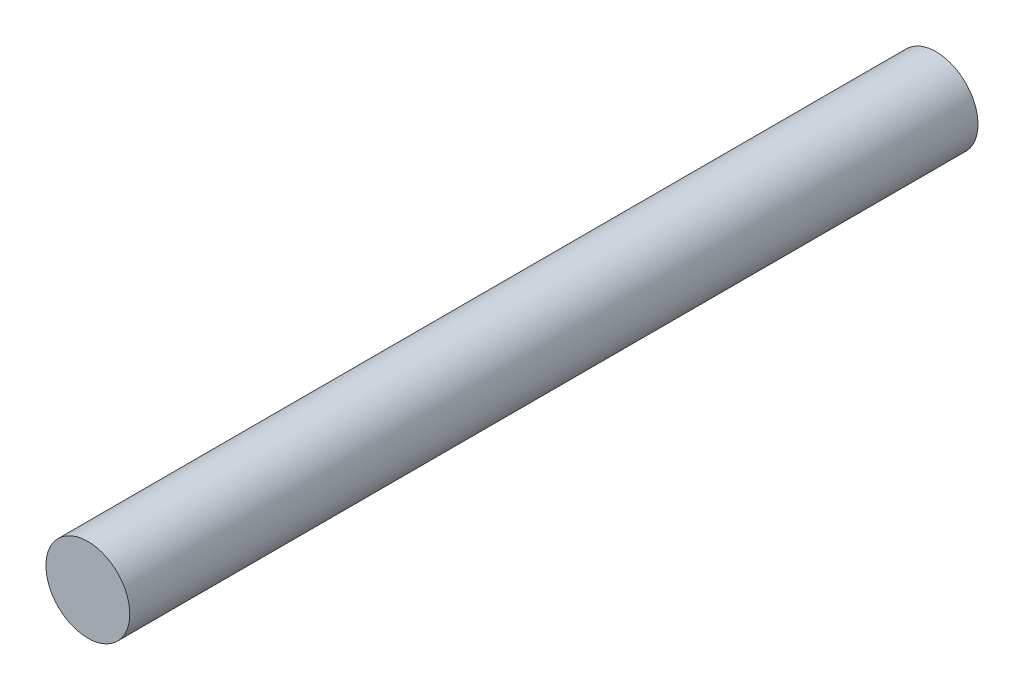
from build123d import *

# Parameters (mm, degrees)
SKETCH1_R      = 2.8829
EXTRUDE1_DEPTH = 58.3184


with BuildPart() as part:
    # Sketch1 → Extrude1 (new body)
    with BuildSketch(Plane.XY):
        Circle(SKETCH1_R)
    extrude(amount=EXTRUDE1_DEPTH)


solid = part.part
